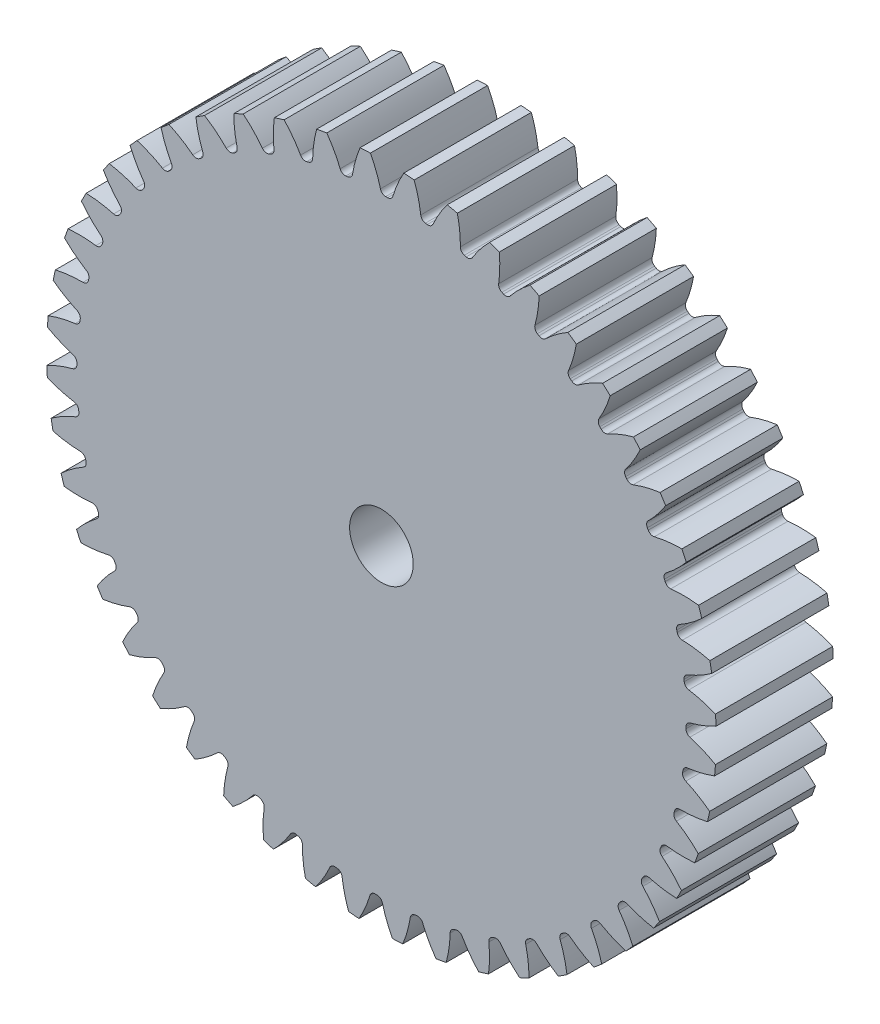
from build123d import *

# Parameters (mm, degrees)
SKETCH3_R         = 254
GEARBODY_DEPTH    = 88.9
TOOTHCUT_DEPTH    = 371.047578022
CIRPATTERN1_COUNT = 48
BOREDIA_R         = 24.13
BORE_DEPTH        = 12700


with BuildPart() as part:
    # Sketch3 → gearBody (new body)
    with BuildSketch(Plane.XY):
        Circle(SKETCH3_R)
    extrude(amount=GEARBODY_DEPTH)

    # Sketch2 → toothCut (cut, through all)
    with BuildSketch(Plane.XY):
        with BuildLine():
            ThreePointArc((231.093101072, -4.655989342), (231.106462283, -3.937345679), (231.117588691, -3.218663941))
            ThreePointArc((231.117588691, -3.218663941), (231.999956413, -0.72253748), (234.215510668, 0.72678631))
            ThreePointArc((234.215510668, 0.72678631), (244.336613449, 3.998729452), (254, 8.444097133))
            ThreePointArc((254, 8.444097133), (254.103446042, -4.329143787), (253.564952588, -17.091448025))
            ThreePointArc((253.564952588, -17.091448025), (244.058601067, -12.319486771), (234.054827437, -8.704677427))
            ThreePointArc((234.054827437, -8.704677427), (231.889928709, -7.180724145), (231.093101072, -4.655989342))
        make_face()
    toothcut = extrude(amount=TOOTHCUT_DEPTH, mode=Mode.SUBTRACT)

    # CirPattern1: toothCut ×48 about axis
    cirpattern1_axis = Axis((0, 0, 0), (0, 0, 1))
    for i in range(1, CIRPATTERN1_COUNT):
        add(toothcut.rotate(cirpattern1_axis, i * 360 / CIRPATTERN1_COUNT), mode=Mode.SUBTRACT)

    # boreDia → bore (cut, symmetric)
    with BuildSketch(Plane.XY):
        Circle(BOREDIA_R)
    extrude(amount=BORE_DEPTH, both=True, mode=Mode.SUBTRACT)


solid = part.part
